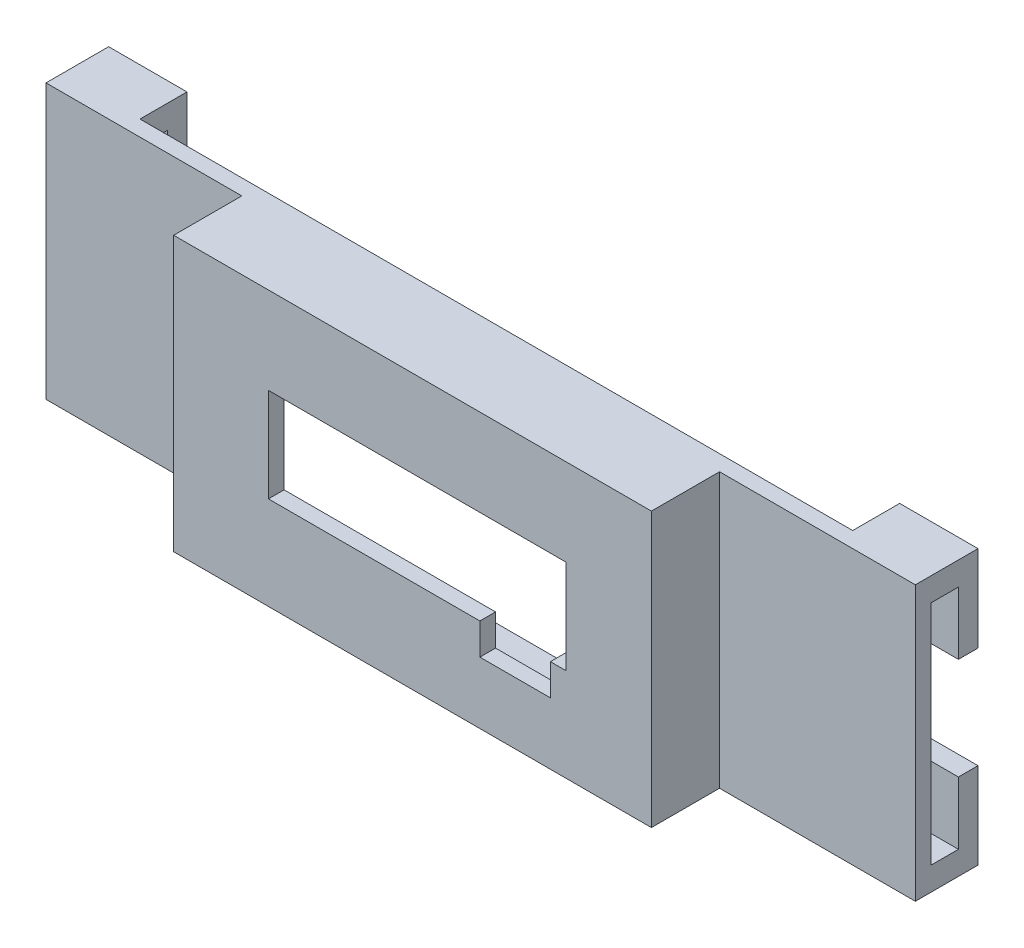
ISO-10303-21;
HEADER;
FILE_DESCRIPTION(('STEP AP214'),'2;1');
FILE_NAME('part.step','',(''),(''),'','','');
FILE_SCHEMA(('AUTOMOTIVE_DESIGN { 1 0 10303 214 1 1 1 1 }'));
ENDSEC;
DATA;
#1=APPLICATION_CONTEXT('core data for automotive mechanical design processes');
#2=APPLICATION_PROTOCOL_DEFINITION('international standard','automotive_design',2000,#1);
#3=PRODUCT_CONTEXT('',#1,'mechanical');
#4=PRODUCT('Part','Part','',(#3));
#5=PRODUCT_RELATED_PRODUCT_CATEGORY('part','',(#4));
#6=PRODUCT_DEFINITION_FORMATION('','',#4);
#7=PRODUCT_DEFINITION_CONTEXT('part definition',#1,'design');
#8=PRODUCT_DEFINITION('design','',#6,#7);
#9=PRODUCT_DEFINITION_SHAPE('','',#8);
#10=(LENGTH_UNIT() NAMED_UNIT(*) SI_UNIT(.MILLI.,.METRE.));
#11=(NAMED_UNIT(*) PLANE_ANGLE_UNIT() SI_UNIT($,.RADIAN.));
#12=(NAMED_UNIT(*) SI_UNIT($,.STERADIAN.) SOLID_ANGLE_UNIT());
#13=UNCERTAINTY_MEASURE_WITH_UNIT(LENGTH_MEASURE(1.E-05),#10,'distance_accuracy_value','');
#14=(GEOMETRIC_REPRESENTATION_CONTEXT(3) GLOBAL_UNCERTAINTY_ASSIGNED_CONTEXT((#13)) GLOBAL_UNIT_ASSIGNED_CONTEXT((#10,
#11,#12)) REPRESENTATION_CONTEXT('',''));
#15=CARTESIAN_POINT('',(0.,0.,0.));
#16=DIRECTION('',(0.,0.,1.));
#17=DIRECTION('',(1.,0.,0.));
#18=AXIS2_PLACEMENT_3D('',#15,#16,#17);
#19=CARTESIAN_POINT('',(-55.5,-14.5,-14.7));
#20=DIRECTION('',(0.,-1.,0.));
#21=DIRECTION('',(1.,0.,0.));
#22=AXIS2_PLACEMENT_3D('',#19,#20,#21);
#23=PLANE('',#22);
#24=DIRECTION('',(1.,0.,0.));
#25=VECTOR('',#24,1.);
#26=CARTESIAN_POINT('',(-55.5,-14.5,-12.2));
#27=LINE('',#26,#25);
#28=CARTESIAN_POINT('',(-55.5,-14.5,-12.2));
#29=VERTEX_POINT('',#28);
#30=CARTESIAN_POINT('',(-45.5,-14.5,-12.2));
#31=VERTEX_POINT('',#30);
#32=EDGE_CURVE('E318',#29,#31,#27,.T.);
#33=ORIENTED_EDGE('',*,*,#32,.F.);
#34=DIRECTION('',(0.,0.,1.));
#35=VECTOR('',#34,1.);
#36=CARTESIAN_POINT('',(-55.5,-14.5,-14.7));
#37=LINE('',#36,#35);
#38=CARTESIAN_POINT('',(-55.5,-14.5,-8.7));
#39=VERTEX_POINT('',#38);
#40=EDGE_CURVE('E323',#29,#39,#37,.T.);
#41=ORIENTED_EDGE('',*,*,#40,.T.);
#42=DIRECTION('',(1.,0.,0.));
#43=VECTOR('',#42,1.);
#44=CARTESIAN_POINT('',(-55.5,-14.5,-8.7));
#45=LINE('',#44,#43);
#46=CARTESIAN_POINT('',(-45.5,-14.5,-8.7));
#47=VERTEX_POINT('',#46);
#48=EDGE_CURVE('E324',#39,#47,#45,.T.);
#49=ORIENTED_EDGE('',*,*,#48,.T.);
#50=DIRECTION('',(0.,0.,1.));
#51=VECTOR('',#50,1.);
#52=CARTESIAN_POINT('',(-45.5,-14.5,-14.7));
#53=LINE('',#52,#51);
#54=EDGE_CURVE('E55',#31,#47,#53,.T.);
#55=ORIENTED_EDGE('',*,*,#54,.F.);
#56=EDGE_LOOP('',(#33,#41,#49,#55));
#57=FACE_BOUND('',#56,.T.);
#58=ADVANCED_FACE('F40',(#57),#23,.F.);
#59=CARTESIAN_POINT('',(0.,0.,-8.7));
#60=DIRECTION('',(0.,0.,-1.));
#61=DIRECTION('',(-1.,0.,0.));
#62=AXIS2_PLACEMENT_3D('',#59,#60,#61);
#63=PLANE('',#62);
#64=DIRECTION('',(-1.,0.,0.));
#65=VECTOR('',#64,1.);
#66=CARTESIAN_POINT('',(28.5,-15.5,-8.7));
#67=LINE('',#66,#65);
#68=CARTESIAN_POINT('',(28.5,-15.5,-8.7));
#69=VERTEX_POINT('',#68);
#70=CARTESIAN_POINT('',(-28.5,-15.5,-8.7));
#71=VERTEX_POINT('',#70);
#72=EDGE_CURVE('E501',#69,#71,#67,.T.);
#73=ORIENTED_EDGE('',*,*,#72,.F.);
#74=DIRECTION('',(0.,-1.,0.));
#75=VECTOR('',#74,1.);
#76=CARTESIAN_POINT('',(28.5,15.5,-8.7));
#77=LINE('',#76,#75);
#78=CARTESIAN_POINT('',(28.5,15.5,-8.7));
#79=VERTEX_POINT('',#78);
#80=EDGE_CURVE('E499',#79,#69,#77,.T.);
#81=ORIENTED_EDGE('',*,*,#80,.F.);
#82=DIRECTION('',(1.,0.,0.));
#83=VECTOR('',#82,1.);
#84=CARTESIAN_POINT('',(28.5,15.5,-8.7));
#85=LINE('',#84,#83);
#86=CARTESIAN_POINT('',(-28.5,15.5,-8.7));
#87=VERTEX_POINT('',#86);
#88=EDGE_CURVE('E507',#87,#79,#85,.T.);
#89=ORIENTED_EDGE('',*,*,#88,.F.);
#90=DIRECTION('',(0.,1.,0.));
#91=VECTOR('',#90,1.);
#92=CARTESIAN_POINT('',(-28.5,15.5,-8.7));
#93=LINE('',#92,#91);
#94=EDGE_CURVE('E504',#71,#87,#93,.T.);
#95=ORIENTED_EDGE('',*,*,#94,.F.);
#96=EDGE_LOOP('',(#73,#81,#89,#95));
#97=FACE_BOUND('',#96,.T.);
#98=DIRECTION('',(0.,-1.,0.));
#99=VECTOR('',#98,1.);
#100=CARTESIAN_POINT('',(-45.5,-17.5,-8.7));
#101=LINE('',#100,#99);
#102=CARTESIAN_POINT('',(-45.5,-17.5,-8.7));
#103=VERTEX_POINT('',#102);
#104=EDGE_CURVE('E327',#47,#103,#101,.T.);
#105=ORIENTED_EDGE('',*,*,#104,.F.);
#106=ORIENTED_EDGE('',*,*,#48,.F.);
#107=DIRECTION('',(0.,1.,0.));
#108=VECTOR('',#107,1.);
#109=CARTESIAN_POINT('',(-55.5,17.5,-8.7));
#110=LINE('',#109,#108);
#111=CARTESIAN_POINT('',(-55.5,14.5,-8.7));
#112=VERTEX_POINT('',#111);
#113=EDGE_CURVE('E387',#39,#112,#110,.T.);
#114=ORIENTED_EDGE('',*,*,#113,.T.);
#115=DIRECTION('',(1.,0.,0.));
#116=VECTOR('',#115,1.);
#117=CARTESIAN_POINT('',(-55.5,14.5,-8.7));
#118=LINE('',#117,#116);
#119=CARTESIAN_POINT('',(-45.5,14.5,-8.7));
#120=VERTEX_POINT('',#119);
#121=EDGE_CURVE('E369',#112,#120,#118,.T.);
#122=ORIENTED_EDGE('',*,*,#121,.T.);
#123=DIRECTION('',(0.,1.,0.));
#124=VECTOR('',#123,1.);
#125=CARTESIAN_POINT('',(-45.5,17.5,-8.7));
#126=LINE('',#125,#124);
#127=CARTESIAN_POINT('',(-45.5,17.5,-8.7));
#128=VERTEX_POINT('',#127);
#129=EDGE_CURVE('E365',#120,#128,#126,.T.);
#130=ORIENTED_EDGE('',*,*,#129,.T.);
#131=DIRECTION('',(1.,0.,0.));
#132=VECTOR('',#131,1.);
#133=CARTESIAN_POINT('',(30.5,17.5,-8.7));
#134=LINE('',#133,#132);
#135=CARTESIAN_POINT('',(45.5,17.5,-8.7));
#136=VERTEX_POINT('',#135);
#137=EDGE_CURVE('E529',#128,#136,#134,.T.);
#138=ORIENTED_EDGE('',*,*,#137,.T.);
#139=DIRECTION('',(0.,1.,0.));
#140=VECTOR('',#139,1.);
#141=CARTESIAN_POINT('',(45.5,17.5,-8.7));
#142=LINE('',#141,#140);
#143=CARTESIAN_POINT('',(45.5,14.5,-8.7));
#144=VERTEX_POINT('',#143);
#145=EDGE_CURVE('E464',#144,#136,#142,.T.);
#146=ORIENTED_EDGE('',*,*,#145,.F.);
#147=DIRECTION('',(-1.,0.,0.));
#148=VECTOR('',#147,1.);
#149=CARTESIAN_POINT('',(55.5,14.5,-8.7));
#150=LINE('',#149,#148);
#151=CARTESIAN_POINT('',(55.5,14.5,-8.7));
#152=VERTEX_POINT('',#151);
#153=EDGE_CURVE('E460',#152,#144,#150,.T.);
#154=ORIENTED_EDGE('',*,*,#153,.F.);
#155=DIRECTION('',(0.,1.,0.));
#156=VECTOR('',#155,1.);
#157=CARTESIAN_POINT('',(55.5,17.5,-8.7));
#158=LINE('',#157,#156);
#159=CARTESIAN_POINT('',(55.5,-14.5,-8.7));
#160=VERTEX_POINT('',#159);
#161=EDGE_CURVE('E482',#160,#152,#158,.T.);
#162=ORIENTED_EDGE('',*,*,#161,.F.);
#163=DIRECTION('',(-1.,0.,0.));
#164=VECTOR('',#163,1.);
#165=CARTESIAN_POINT('',(55.5,-14.5,-8.7));
#166=LINE('',#165,#164);
#167=CARTESIAN_POINT('',(45.5,-14.5,-8.7));
#168=VERTEX_POINT('',#167);
#169=EDGE_CURVE('E427',#160,#168,#166,.T.);
#170=ORIENTED_EDGE('',*,*,#169,.T.);
#171=DIRECTION('',(0.,-1.,0.));
#172=VECTOR('',#171,1.);
#173=CARTESIAN_POINT('',(45.5,-17.5,-8.7));
#174=LINE('',#173,#172);
#175=CARTESIAN_POINT('',(45.5,-17.5,-8.7));
#176=VERTEX_POINT('',#175);
#177=EDGE_CURVE('E423',#168,#176,#174,.T.);
#178=ORIENTED_EDGE('',*,*,#177,.T.);
#179=DIRECTION('',(-1.,0.,0.));
#180=VECTOR('',#179,1.);
#181=CARTESIAN_POINT('',(30.5,-17.5,-8.7));
#182=LINE('',#181,#180);
#183=EDGE_CURVE('E62',#176,#103,#182,.T.);
#184=ORIENTED_EDGE('',*,*,#183,.T.);
#185=EDGE_LOOP('',(#105,#106,#114,#122,#130,#138,#146,#154,#162,#170,#178,#184));
#186=FACE_BOUND('',#185,.T.);
#187=ADVANCED_FACE('F642',(#97,#186),#63,.T.);
#188=CARTESIAN_POINT('',(55.5,14.5,-14.7));
#189=DIRECTION('',(0.,1.,0.));
#190=DIRECTION('',(0.,0.,1.));
#191=AXIS2_PLACEMENT_3D('',#188,#189,#190);
#192=PLANE('',#191);
#193=DIRECTION('',(-1.,0.,0.));
#194=VECTOR('',#193,1.);
#195=CARTESIAN_POINT('',(55.5,14.5,-12.2));
#196=LINE('',#195,#194);
#197=CARTESIAN_POINT('',(55.5,14.5,-12.2));
#198=VERTEX_POINT('',#197);
#199=CARTESIAN_POINT('',(45.5,14.5,-12.2));
#200=VERTEX_POINT('',#199);
#201=EDGE_CURVE('E442',#198,#200,#196,.T.);
#202=ORIENTED_EDGE('',*,*,#201,.F.);
#203=DIRECTION('',(0.,0.,1.));
#204=VECTOR('',#203,1.);
#205=CARTESIAN_POINT('',(55.5,14.5,-14.7));
#206=LINE('',#205,#204);
#207=EDGE_CURVE('E478',#198,#152,#206,.T.);
#208=ORIENTED_EDGE('',*,*,#207,.T.);
#209=ORIENTED_EDGE('',*,*,#153,.T.);
#210=DIRECTION('',(0.,0.,1.));
#211=VECTOR('',#210,1.);
#212=CARTESIAN_POINT('',(45.5,14.5,-14.7));
#213=LINE('',#212,#211);
#214=EDGE_CURVE('E476',#200,#144,#213,.T.);
#215=ORIENTED_EDGE('',*,*,#214,.F.);
#216=EDGE_LOOP('',(#202,#208,#209,#215));
#217=FACE_BOUND('',#216,.T.);
#218=ADVANCED_FACE('F647',(#217),#192,.F.);
#219=CARTESIAN_POINT('',(30.5,17.5,2.));
#220=DIRECTION('',(-1.,0.,0.));
#221=DIRECTION('',(0.,-1.,0.));
#222=AXIS2_PLACEMENT_3D('',#219,#220,#221);
#223=PLANE('',#222);
#224=DIRECTION('',(0.,-1.,0.));
#225=VECTOR('',#224,1.);
#226=CARTESIAN_POINT('',(30.5,17.5,-6.7));
#227=LINE('',#226,#225);
#228=CARTESIAN_POINT('',(30.5,17.5,-6.7));
#229=VERTEX_POINT('',#228);
#230=CARTESIAN_POINT('',(30.5,-17.5,-6.7));
#231=VERTEX_POINT('',#230);
#232=EDGE_CURVE('E481',#229,#231,#227,.T.);
#233=ORIENTED_EDGE('',*,*,#232,.F.);
#234=DIRECTION('',(0.,0.,-1.));
#235=VECTOR('',#234,1.);
#236=CARTESIAN_POINT('',(30.5,17.5,2.));
#237=LINE('',#236,#235);
#238=CARTESIAN_POINT('',(30.5,17.5,2.));
#239=VERTEX_POINT('',#238);
#240=EDGE_CURVE('E602',#239,#229,#237,.T.);
#241=ORIENTED_EDGE('',*,*,#240,.F.);
#242=DIRECTION('',(0.,1.,0.));
#243=VECTOR('',#242,1.);
#244=CARTESIAN_POINT('',(30.5,17.5,2.));
#245=LINE('',#244,#243);
#246=CARTESIAN_POINT('',(30.5,-17.5,2.));
#247=VERTEX_POINT('',#246);
#248=EDGE_CURVE('E595',#247,#239,#245,.T.);
#249=ORIENTED_EDGE('',*,*,#248,.F.);
#250=DIRECTION('',(0.,0.,-1.));
#251=VECTOR('',#250,1.);
#252=CARTESIAN_POINT('',(30.5,-17.5,2.));
#253=LINE('',#252,#251);
#254=EDGE_CURVE('E48',#247,#231,#253,.T.);
#255=ORIENTED_EDGE('',*,*,#254,.T.);
#256=EDGE_LOOP('',(#233,#241,#249,#255));
#257=FACE_BOUND('',#256,.T.);
#258=ADVANCED_FACE('F607',(#257),#223,.F.);
#259=CARTESIAN_POINT('',(0.,0.,2.));
#260=DIRECTION('',(0.,0.,1.));
#261=DIRECTION('',(1.,0.,0.));
#262=AXIS2_PLACEMENT_3D('',#259,#260,#261);
#263=PLANE('',#262);
#264=DIRECTION('',(0.,-1.,0.));
#265=VECTOR('',#264,1.);
#266=CARTESIAN_POINT('',(-30.5,17.5,2.));
#267=LINE('',#266,#265);
#268=CARTESIAN_POINT('',(-30.5,17.5,2.));
#269=VERTEX_POINT('',#268);
#270=CARTESIAN_POINT('',(-30.5,-17.5,2.));
#271=VERTEX_POINT('',#270);
#272=EDGE_CURVE('E590',#269,#271,#267,.T.);
#273=ORIENTED_EDGE('',*,*,#272,.T.);
#274=DIRECTION('',(1.,0.,0.));
#275=VECTOR('',#274,1.);
#276=CARTESIAN_POINT('',(-30.5,-17.5,2.));
#277=LINE('',#276,#275);
#278=EDGE_CURVE('E593',#271,#247,#277,.T.);
#279=ORIENTED_EDGE('',*,*,#278,.T.);
#280=ORIENTED_EDGE('',*,*,#248,.T.);
#281=DIRECTION('',(-1.,0.,0.));
#282=VECTOR('',#281,1.);
#283=CARTESIAN_POINT('',(-30.5,17.5,2.));
#284=LINE('',#283,#282);
#285=EDGE_CURVE('E597',#239,#269,#284,.T.);
#286=ORIENTED_EDGE('',*,*,#285,.T.);
#287=EDGE_LOOP('',(#273,#279,#280,#286));
#288=FACE_BOUND('',#287,.T.);
#289=DIRECTION('',(1.,0.,0.));
#290=VECTOR('',#289,1.);
#291=CARTESIAN_POINT('',(-18.4,-5.6,2.));
#292=LINE('',#291,#290);
#293=CARTESIAN_POINT('',(-18.4,-5.6,2.));
#294=VERTEX_POINT('',#293);
#295=CARTESIAN_POINT('',(8.6,-5.6,2.));
#296=VERTEX_POINT('',#295);
#297=EDGE_CURVE('E534',#294,#296,#292,.T.);
#298=ORIENTED_EDGE('',*,*,#297,.F.);
#299=DIRECTION('',(0.,-1.,0.));
#300=VECTOR('',#299,1.);
#301=CARTESIAN_POINT('',(-18.4,6.4,2.));
#302=LINE('',#301,#300);
#303=CARTESIAN_POINT('',(-18.4,6.4,2.));
#304=VERTEX_POINT('',#303);
#305=EDGE_CURVE('E532',#304,#294,#302,.T.);
#306=ORIENTED_EDGE('',*,*,#305,.F.);
#307=DIRECTION('',(-1.,0.,0.));
#308=VECTOR('',#307,1.);
#309=CARTESIAN_POINT('',(-18.4,6.4,2.));
#310=LINE('',#309,#308);
#311=CARTESIAN_POINT('',(19.6,6.4,2.));
#312=VERTEX_POINT('',#311);
#313=EDGE_CURVE('E548',#312,#304,#310,.T.);
#314=ORIENTED_EDGE('',*,*,#313,.F.);
#315=DIRECTION('',(0.,1.,0.));
#316=VECTOR('',#315,1.);
#317=CARTESIAN_POINT('',(19.6,6.4,2.));
#318=LINE('',#317,#316);
#319=CARTESIAN_POINT('',(19.6,-5.6,2.));
#320=VERTEX_POINT('',#319);
#321=EDGE_CURVE('E545',#320,#312,#318,.T.);
#322=ORIENTED_EDGE('',*,*,#321,.F.);
#323=DIRECTION('',(1.,0.,0.));
#324=VECTOR('',#323,1.);
#325=CARTESIAN_POINT('',(17.6,-5.6,2.));
#326=LINE('',#325,#324);
#327=CARTESIAN_POINT('',(17.6,-5.6,2.));
#328=VERTEX_POINT('',#327);
#329=EDGE_CURVE('E543',#328,#320,#326,.T.);
#330=ORIENTED_EDGE('',*,*,#329,.F.);
#331=DIRECTION('',(0.,1.,0.));
#332=VECTOR('',#331,1.);
#333=CARTESIAN_POINT('',(17.6,-5.6,2.));
#334=LINE('',#333,#332);
#335=CARTESIAN_POINT('',(17.6,-9.6,2.));
#336=VERTEX_POINT('',#335);
#337=EDGE_CURVE('E541',#336,#328,#334,.T.);
#338=ORIENTED_EDGE('',*,*,#337,.F.);
#339=DIRECTION('',(1.,0.,0.));
#340=VECTOR('',#339,1.);
#341=CARTESIAN_POINT('',(8.6,-9.6,2.));
#342=LINE('',#341,#340);
#343=CARTESIAN_POINT('',(8.6,-9.6,2.));
#344=VERTEX_POINT('',#343);
#345=EDGE_CURVE('E539',#344,#336,#342,.T.);
#346=ORIENTED_EDGE('',*,*,#345,.F.);
#347=DIRECTION('',(0.,-1.,0.));
#348=VECTOR('',#347,1.);
#349=CARTESIAN_POINT('',(8.6,-5.6,2.));
#350=LINE('',#349,#348);
#351=EDGE_CURVE('E537',#296,#344,#350,.T.);
#352=ORIENTED_EDGE('',*,*,#351,.F.);
#353=EDGE_LOOP('',(#298,#306,#314,#322,#330,#338,#346,#352));
#354=FACE_BOUND('',#353,.T.);
#355=ADVANCED_FACE('F668',(#288,#354),#263,.T.);
#356=CARTESIAN_POINT('',(0.,0.,0.));
#357=DIRECTION('',(0.,0.,1.));
#358=DIRECTION('',(1.,0.,0.));
#359=AXIS2_PLACEMENT_3D('',#356,#357,#358);
#360=PLANE('',#359);
#361=DIRECTION('',(1.,0.,0.));
#362=VECTOR('',#361,1.);
#363=CARTESIAN_POINT('',(28.5,15.5,0.));
#364=LINE('',#363,#362);
#365=CARTESIAN_POINT('',(-28.5,15.5,0.));
#366=VERTEX_POINT('',#365);
#367=CARTESIAN_POINT('',(28.5,15.5,0.));
#368=VERTEX_POINT('',#367);
#369=EDGE_CURVE('E502',#366,#368,#364,.T.);
#370=ORIENTED_EDGE('',*,*,#369,.T.);
#371=DIRECTION('',(0.,-1.,0.));
#372=VECTOR('',#371,1.);
#373=CARTESIAN_POINT('',(28.5,15.5,0.));
#374=LINE('',#373,#372);
#375=CARTESIAN_POINT('',(28.5,-15.5,0.));
#376=VERTEX_POINT('',#375);
#377=EDGE_CURVE('E498',#368,#376,#374,.T.);
#378=ORIENTED_EDGE('',*,*,#377,.T.);
#379=DIRECTION('',(-1.,0.,0.));
#380=VECTOR('',#379,1.);
#381=CARTESIAN_POINT('',(28.5,-15.5,0.));
#382=LINE('',#381,#380);
#383=CARTESIAN_POINT('',(-28.5,-15.5,0.));
#384=VERTEX_POINT('',#383);
#385=EDGE_CURVE('E512',#376,#384,#382,.T.);
#386=ORIENTED_EDGE('',*,*,#385,.T.);
#387=DIRECTION('',(0.,1.,0.));
#388=VECTOR('',#387,1.);
#389=CARTESIAN_POINT('',(-28.5,15.5,0.));
#390=LINE('',#389,#388);
#391=EDGE_CURVE('E515',#384,#366,#390,.T.);
#392=ORIENTED_EDGE('',*,*,#391,.T.);
#393=EDGE_LOOP('',(#370,#378,#386,#392));
#394=FACE_BOUND('',#393,.T.);
#395=DIRECTION('',(0.,-1.,0.));
#396=VECTOR('',#395,1.);
#397=CARTESIAN_POINT('',(-18.4,6.4,0.));
#398=LINE('',#397,#396);
#399=CARTESIAN_POINT('',(-18.4,6.4,0.));
#400=VERTEX_POINT('',#399);
#401=CARTESIAN_POINT('',(-18.4,-5.6,0.));
#402=VERTEX_POINT('',#401);
#403=EDGE_CURVE('E531',#400,#402,#398,.T.);
#404=ORIENTED_EDGE('',*,*,#403,.T.);
#405=DIRECTION('',(1.,0.,0.));
#406=VECTOR('',#405,1.);
#407=CARTESIAN_POINT('',(-18.4,-5.6,0.));
#408=LINE('',#407,#406);
#409=CARTESIAN_POINT('',(8.6,-5.6,0.));
#410=VERTEX_POINT('',#409);
#411=EDGE_CURVE('E553',#402,#410,#408,.T.);
#412=ORIENTED_EDGE('',*,*,#411,.T.);
#413=DIRECTION('',(0.,-1.,0.));
#414=VECTOR('',#413,1.);
#415=CARTESIAN_POINT('',(8.6,-5.6,0.));
#416=LINE('',#415,#414);
#417=CARTESIAN_POINT('',(8.6,-9.6,0.));
#418=VERTEX_POINT('',#417);
#419=EDGE_CURVE('E556',#410,#418,#416,.T.);
#420=ORIENTED_EDGE('',*,*,#419,.T.);
#421=DIRECTION('',(1.,0.,0.));
#422=VECTOR('',#421,1.);
#423=CARTESIAN_POINT('',(8.6,-9.6,0.));
#424=LINE('',#423,#422);
#425=CARTESIAN_POINT('',(17.6,-9.6,0.));
#426=VERTEX_POINT('',#425);
#427=EDGE_CURVE('E559',#418,#426,#424,.T.);
#428=ORIENTED_EDGE('',*,*,#427,.T.);
#429=DIRECTION('',(0.,1.,0.));
#430=VECTOR('',#429,1.);
#431=CARTESIAN_POINT('',(17.6,-5.6,0.));
#432=LINE('',#431,#430);
#433=CARTESIAN_POINT('',(17.6,-5.6,0.));
#434=VERTEX_POINT('',#433);
#435=EDGE_CURVE('E562',#426,#434,#432,.T.);
#436=ORIENTED_EDGE('',*,*,#435,.T.);
#437=DIRECTION('',(1.,0.,0.));
#438=VECTOR('',#437,1.);
#439=CARTESIAN_POINT('',(17.6,-5.6,0.));
#440=LINE('',#439,#438);
#441=CARTESIAN_POINT('',(19.6,-5.6,0.));
#442=VERTEX_POINT('',#441);
#443=EDGE_CURVE('E565',#434,#442,#440,.T.);
#444=ORIENTED_EDGE('',*,*,#443,.T.);
#445=DIRECTION('',(0.,1.,0.));
#446=VECTOR('',#445,1.);
#447=CARTESIAN_POINT('',(19.6,6.4,0.));
#448=LINE('',#447,#446);
#449=CARTESIAN_POINT('',(19.6,6.4,0.));
#450=VERTEX_POINT('',#449);
#451=EDGE_CURVE('E568',#442,#450,#448,.T.);
#452=ORIENTED_EDGE('',*,*,#451,.T.);
#453=DIRECTION('',(-1.,0.,0.));
#454=VECTOR('',#453,1.);
#455=CARTESIAN_POINT('',(-18.4,6.4,0.));
#456=LINE('',#455,#454);
#457=EDGE_CURVE('E535',#450,#400,#456,.T.);
#458=ORIENTED_EDGE('',*,*,#457,.T.);
#459=EDGE_LOOP('',(#404,#412,#420,#428,#436,#444,#452,#458));
#460=FACE_BOUND('',#459,.T.);
#461=ADVANCED_FACE('F811',(#394,#460),#360,.F.);
#462=CARTESIAN_POINT('',(-30.5,17.5,2.));
#463=DIRECTION('',(1.,0.,0.));
#464=DIRECTION('',(0.,0.,-1.));
#465=AXIS2_PLACEMENT_3D('',#462,#463,#464);
#466=PLANE('',#465);
#467=DIRECTION('',(0.,0.,-1.));
#468=VECTOR('',#467,1.);
#469=CARTESIAN_POINT('',(-30.5,17.5,2.));
#470=LINE('',#469,#468);
#471=CARTESIAN_POINT('',(-30.5,17.5,-6.7));
#472=VERTEX_POINT('',#471);
#473=EDGE_CURVE('E599',#269,#472,#470,.T.);
#474=ORIENTED_EDGE('',*,*,#473,.T.);
#475=DIRECTION('',(0.,-1.,0.));
#476=VECTOR('',#475,1.);
#477=CARTESIAN_POINT('',(-30.5,17.5,-6.7));
#478=LINE('',#477,#476);
#479=CARTESIAN_POINT('',(-30.5,-17.5,-6.7));
#480=VERTEX_POINT('',#479);
#481=EDGE_CURVE('E386',#472,#480,#478,.T.);
#482=ORIENTED_EDGE('',*,*,#481,.T.);
#483=DIRECTION('',(0.,0.,-1.));
#484=VECTOR('',#483,1.);
#485=CARTESIAN_POINT('',(-30.5,-17.5,2.));
#486=LINE('',#485,#484);
#487=EDGE_CURVE('E11',#271,#480,#486,.T.);
#488=ORIENTED_EDGE('',*,*,#487,.F.);
#489=ORIENTED_EDGE('',*,*,#272,.F.);
#490=EDGE_LOOP('',(#474,#482,#488,#489));
#491=FACE_BOUND('',#490,.T.);
#492=ADVANCED_FACE('F42',(#491),#466,.F.);
#493=CARTESIAN_POINT('',(-30.5,-17.5,2.));
#494=DIRECTION('',(0.,1.,0.));
#495=DIRECTION('',(0.,0.,1.));
#496=AXIS2_PLACEMENT_3D('',#493,#494,#495);
#497=PLANE('',#496);
#498=ORIENTED_EDGE('',*,*,#487,.T.);
#499=DIRECTION('',(1.,0.,0.));
#500=VECTOR('',#499,1.);
#501=CARTESIAN_POINT('',(-55.5,-17.5,-6.7));
#502=LINE('',#501,#500);
#503=CARTESIAN_POINT('',(-55.5,-17.5,-6.7));
#504=VERTEX_POINT('',#503);
#505=EDGE_CURVE('E401',#504,#480,#502,.T.);
#506=ORIENTED_EDGE('',*,*,#505,.F.);
#507=DIRECTION('',(0.,0.,-1.));
#508=VECTOR('',#507,1.);
#509=CARTESIAN_POINT('',(-55.5,-17.5,-8.7));
#510=LINE('',#509,#508);
#511=CARTESIAN_POINT('',(-55.5,-17.5,-14.7));
#512=VERTEX_POINT('',#511);
#513=EDGE_CURVE('E389',#504,#512,#510,.T.);
#514=ORIENTED_EDGE('',*,*,#513,.T.);
#515=DIRECTION('',(-1.,0.,0.));
#516=VECTOR('',#515,1.);
#517=CARTESIAN_POINT('',(-55.5,-17.5,-14.7));
#518=LINE('',#517,#516);
#519=CARTESIAN_POINT('',(-45.5,-17.5,-14.7));
#520=VERTEX_POINT('',#519);
#521=EDGE_CURVE('E336',#520,#512,#518,.T.);
#522=ORIENTED_EDGE('',*,*,#521,.F.);
#523=DIRECTION('',(0.,0.,1.));
#524=VECTOR('',#523,1.);
#525=CARTESIAN_POINT('',(-45.5,-17.5,-14.7));
#526=LINE('',#525,#524);
#527=EDGE_CURVE('E338',#520,#103,#526,.T.);
#528=ORIENTED_EDGE('',*,*,#527,.T.);
#529=ORIENTED_EDGE('',*,*,#183,.F.);
#530=DIRECTION('',(0.,0.,1.));
#531=VECTOR('',#530,1.);
#532=CARTESIAN_POINT('',(45.5,-17.5,-14.7));
#533=LINE('',#532,#531);
#534=CARTESIAN_POINT('',(45.5,-17.5,-14.7));
#535=VERTEX_POINT('',#534);
#536=EDGE_CURVE('E440',#535,#176,#533,.T.);
#537=ORIENTED_EDGE('',*,*,#536,.F.);
#538=DIRECTION('',(1.,0.,0.));
#539=VECTOR('',#538,1.);
#540=CARTESIAN_POINT('',(55.5,-17.5,-14.7));
#541=LINE('',#540,#539);
#542=CARTESIAN_POINT('',(55.5,-17.5,-14.7));
#543=VERTEX_POINT('',#542);
#544=EDGE_CURVE('E426',#535,#543,#541,.T.);
#545=ORIENTED_EDGE('',*,*,#544,.T.);
#546=DIRECTION('',(0.,0.,-1.));
#547=VECTOR('',#546,1.);
#548=CARTESIAN_POINT('',(55.5,-17.5,-8.7));
#549=LINE('',#548,#547);
#550=CARTESIAN_POINT('',(55.5,-17.5,-6.7));
#551=VERTEX_POINT('',#550);
#552=EDGE_CURVE('E488',#551,#543,#549,.T.);
#553=ORIENTED_EDGE('',*,*,#552,.F.);
#554=DIRECTION('',(-1.,0.,0.));
#555=VECTOR('',#554,1.);
#556=CARTESIAN_POINT('',(55.5,-17.5,-6.7));
#557=LINE('',#556,#555);
#558=EDGE_CURVE('E490',#551,#231,#557,.T.);
#559=ORIENTED_EDGE('',*,*,#558,.T.);
#560=ORIENTED_EDGE('',*,*,#254,.F.);
#561=ORIENTED_EDGE('',*,*,#278,.F.);
#562=EDGE_LOOP('',(#498,#506,#514,#522,#528,#529,#537,#545,#553,#559,#560,#561));
#563=FACE_BOUND('',#562,.T.);
#564=ADVANCED_FACE('F616',(#563),#497,.F.);
#565=CARTESIAN_POINT('',(-30.5,17.5,2.));
#566=DIRECTION('',(0.,-1.,0.));
#567=DIRECTION('',(0.,0.,-1.));
#568=AXIS2_PLACEMENT_3D('',#565,#566,#567);
#569=PLANE('',#568);
#570=ORIENTED_EDGE('',*,*,#240,.T.);
#571=DIRECTION('',(-1.,0.,0.));
#572=VECTOR('',#571,1.);
#573=CARTESIAN_POINT('',(55.5,17.5,-6.7));
#574=LINE('',#573,#572);
#575=CARTESIAN_POINT('',(55.5,17.5,-6.7));
#576=VERTEX_POINT('',#575);
#577=EDGE_CURVE('E495',#576,#229,#574,.T.);
#578=ORIENTED_EDGE('',*,*,#577,.F.);
#579=DIRECTION('',(0.,0.,1.));
#580=VECTOR('',#579,1.);
#581=CARTESIAN_POINT('',(55.5,17.5,-8.7));
#582=LINE('',#581,#580);
#583=CARTESIAN_POINT('',(55.5,17.5,-14.7));
#584=VERTEX_POINT('',#583);
#585=EDGE_CURVE('E484',#584,#576,#582,.T.);
#586=ORIENTED_EDGE('',*,*,#585,.F.);
#587=DIRECTION('',(1.,0.,0.));
#588=VECTOR('',#587,1.);
#589=CARTESIAN_POINT('',(55.5,17.5,-14.7));
#590=LINE('',#589,#588);
#591=CARTESIAN_POINT('',(45.5,17.5,-14.7));
#592=VERTEX_POINT('',#591);
#593=EDGE_CURVE('E466',#592,#584,#590,.T.);
#594=ORIENTED_EDGE('',*,*,#593,.F.);
#595=DIRECTION('',(0.,0.,1.));
#596=VECTOR('',#595,1.);
#597=CARTESIAN_POINT('',(45.5,17.5,-14.7));
#598=LINE('',#597,#596);
#599=EDGE_CURVE('E469',#592,#136,#598,.T.);
#600=ORIENTED_EDGE('',*,*,#599,.T.);
#601=ORIENTED_EDGE('',*,*,#137,.F.);
#602=DIRECTION('',(0.,0.,1.));
#603=VECTOR('',#602,1.);
#604=CARTESIAN_POINT('',(-45.5,17.5,-14.7));
#605=LINE('',#604,#603);
#606=CARTESIAN_POINT('',(-45.5,17.5,-14.7));
#607=VERTEX_POINT('',#606);
#608=EDGE_CURVE('E383',#607,#128,#605,.T.);
#609=ORIENTED_EDGE('',*,*,#608,.F.);
#610=DIRECTION('',(-1.,0.,0.));
#611=VECTOR('',#610,1.);
#612=CARTESIAN_POINT('',(-55.5,17.5,-14.7));
#613=LINE('',#612,#611);
#614=CARTESIAN_POINT('',(-55.5,17.5,-14.7));
#615=VERTEX_POINT('',#614);
#616=EDGE_CURVE('E368',#607,#615,#613,.T.);
#617=ORIENTED_EDGE('',*,*,#616,.T.);
#618=DIRECTION('',(0.,0.,1.));
#619=VECTOR('',#618,1.);
#620=CARTESIAN_POINT('',(-55.5,17.5,-8.7));
#621=LINE('',#620,#619);
#622=CARTESIAN_POINT('',(-55.5,17.5,-6.7));
#623=VERTEX_POINT('',#622);
#624=EDGE_CURVE('E394',#615,#623,#621,.T.);
#625=ORIENTED_EDGE('',*,*,#624,.T.);
#626=DIRECTION('',(1.,0.,0.));
#627=VECTOR('',#626,1.);
#628=CARTESIAN_POINT('',(-55.5,17.5,-6.7));
#629=LINE('',#628,#627);
#630=EDGE_CURVE('E397',#623,#472,#629,.T.);
#631=ORIENTED_EDGE('',*,*,#630,.T.);
#632=ORIENTED_EDGE('',*,*,#473,.F.);
#633=ORIENTED_EDGE('',*,*,#285,.F.);
#634=EDGE_LOOP('',(#570,#578,#586,#594,#600,#601,#609,#617,#625,#631,#632,#633));
#635=FACE_BOUND('',#634,.T.);
#636=ADVANCED_FACE('F663',(#635),#569,.F.);
#637=CARTESIAN_POINT('',(-18.4,6.4,2.));
#638=DIRECTION('',(1.,0.,0.));
#639=DIRECTION('',(0.,0.,-1.));
#640=AXIS2_PLACEMENT_3D('',#637,#638,#639);
#641=PLANE('',#640);
#642=ORIENTED_EDGE('',*,*,#403,.F.);
#643=DIRECTION('',(0.,0.,-1.));
#644=VECTOR('',#643,1.);
#645=CARTESIAN_POINT('',(-18.4,6.4,2.));
#646=LINE('',#645,#644);
#647=EDGE_CURVE('E550',#304,#400,#646,.T.);
#648=ORIENTED_EDGE('',*,*,#647,.F.);
#649=ORIENTED_EDGE('',*,*,#305,.T.);
#650=DIRECTION('',(0.,0.,-1.));
#651=VECTOR('',#650,1.);
#652=CARTESIAN_POINT('',(-18.4,-5.6,2.));
#653=LINE('',#652,#651);
#654=EDGE_CURVE('E587',#294,#402,#653,.T.);
#655=ORIENTED_EDGE('',*,*,#654,.T.);
#656=EDGE_LOOP('',(#642,#648,#649,#655));
#657=FACE_BOUND('',#656,.T.);
#658=ADVANCED_FACE('F804',(#657),#641,.T.);
#659=CARTESIAN_POINT('',(-18.4,-5.6,2.));
#660=DIRECTION('',(0.,1.,0.));
#661=DIRECTION('',(0.,0.,1.));
#662=AXIS2_PLACEMENT_3D('',#659,#660,#661);
#663=PLANE('',#662);
#664=ORIENTED_EDGE('',*,*,#411,.F.);
#665=ORIENTED_EDGE('',*,*,#654,.F.);
#666=ORIENTED_EDGE('',*,*,#297,.T.);
#667=DIRECTION('',(0.,0.,-1.));
#668=VECTOR('',#667,1.);
#669=CARTESIAN_POINT('',(8.6,-5.6,2.));
#670=LINE('',#669,#668);
#671=EDGE_CURVE('E585',#296,#410,#670,.T.);
#672=ORIENTED_EDGE('',*,*,#671,.T.);
#673=EDGE_LOOP('',(#664,#665,#666,#672));
#674=FACE_BOUND('',#673,.T.);
#675=ADVANCED_FACE('F800',(#674),#663,.T.);
#676=CARTESIAN_POINT('',(8.6,-5.6,2.));
#677=DIRECTION('',(1.,0.,0.));
#678=DIRECTION('',(0.,0.,-1.));
#679=AXIS2_PLACEMENT_3D('',#676,#677,#678);
#680=PLANE('',#679);
#681=ORIENTED_EDGE('',*,*,#419,.F.);
#682=ORIENTED_EDGE('',*,*,#671,.F.);
#683=ORIENTED_EDGE('',*,*,#351,.T.);
#684=DIRECTION('',(0.,0.,-1.));
#685=VECTOR('',#684,1.);
#686=CARTESIAN_POINT('',(8.6,-9.6,2.));
#687=LINE('',#686,#685);
#688=EDGE_CURVE('E583',#344,#418,#687,.T.);
#689=ORIENTED_EDGE('',*,*,#688,.T.);
#690=EDGE_LOOP('',(#681,#682,#683,#689));
#691=FACE_BOUND('',#690,.T.);
#692=ADVANCED_FACE('F796',(#691),#680,.T.);
#693=CARTESIAN_POINT('',(8.6,-9.6,2.));
#694=DIRECTION('',(0.,1.,0.));
#695=DIRECTION('',(-1.,0.,0.));
#696=AXIS2_PLACEMENT_3D('',#693,#694,#695);
#697=PLANE('',#696);
#698=ORIENTED_EDGE('',*,*,#427,.F.);
#699=ORIENTED_EDGE('',*,*,#688,.F.);
#700=ORIENTED_EDGE('',*,*,#345,.T.);
#701=DIRECTION('',(0.,0.,-1.));
#702=VECTOR('',#701,1.);
#703=CARTESIAN_POINT('',(17.6,-9.6,2.));
#704=LINE('',#703,#702);
#705=EDGE_CURVE('E581',#336,#426,#704,.T.);
#706=ORIENTED_EDGE('',*,*,#705,.T.);
#707=EDGE_LOOP('',(#698,#699,#700,#706));
#708=FACE_BOUND('',#707,.T.);
#709=ADVANCED_FACE('F792',(#708),#697,.T.);
#710=CARTESIAN_POINT('',(17.6,-5.6,2.));
#711=DIRECTION('',(-1.,0.,0.));
#712=DIRECTION('',(0.,0.,1.));
#713=AXIS2_PLACEMENT_3D('',#710,#711,#712);
#714=PLANE('',#713);
#715=ORIENTED_EDGE('',*,*,#435,.F.);
#716=ORIENTED_EDGE('',*,*,#705,.F.);
#717=ORIENTED_EDGE('',*,*,#337,.T.);
#718=DIRECTION('',(0.,0.,-1.));
#719=VECTOR('',#718,1.);
#720=CARTESIAN_POINT('',(17.6,-5.6,2.));
#721=LINE('',#720,#719);
#722=EDGE_CURVE('E579',#328,#434,#721,.T.);
#723=ORIENTED_EDGE('',*,*,#722,.T.);
#724=EDGE_LOOP('',(#715,#716,#717,#723));
#725=FACE_BOUND('',#724,.T.);
#726=ADVANCED_FACE('F788',(#725),#714,.T.);
#727=CARTESIAN_POINT('',(17.6,-5.6,2.));
#728=DIRECTION('',(0.,1.,0.));
#729=DIRECTION('',(0.,0.,1.));
#730=AXIS2_PLACEMENT_3D('',#727,#728,#729);
#731=PLANE('',#730);
#732=ORIENTED_EDGE('',*,*,#443,.F.);
#733=ORIENTED_EDGE('',*,*,#722,.F.);
#734=ORIENTED_EDGE('',*,*,#329,.T.);
#735=DIRECTION('',(0.,0.,-1.));
#736=VECTOR('',#735,1.);
#737=CARTESIAN_POINT('',(19.6,-5.6,2.));
#738=LINE('',#737,#736);
#739=EDGE_CURVE('E577',#320,#442,#738,.T.);
#740=ORIENTED_EDGE('',*,*,#739,.T.);
#741=EDGE_LOOP('',(#732,#733,#734,#740));
#742=FACE_BOUND('',#741,.T.);
#743=ADVANCED_FACE('F784',(#742),#731,.T.);
#744=CARTESIAN_POINT('',(19.6,6.4,2.));
#745=DIRECTION('',(-1.,0.,0.));
#746=DIRECTION('',(0.,-1.,0.));
#747=AXIS2_PLACEMENT_3D('',#744,#745,#746);
#748=PLANE('',#747);
#749=ORIENTED_EDGE('',*,*,#451,.F.);
#750=ORIENTED_EDGE('',*,*,#739,.F.);
#751=ORIENTED_EDGE('',*,*,#321,.T.);
#752=DIRECTION('',(0.,0.,-1.));
#753=VECTOR('',#752,1.);
#754=CARTESIAN_POINT('',(19.6,6.4,2.));
#755=LINE('',#754,#753);
#756=EDGE_CURVE('E575',#312,#450,#755,.T.);
#757=ORIENTED_EDGE('',*,*,#756,.T.);
#758=EDGE_LOOP('',(#749,#750,#751,#757));
#759=FACE_BOUND('',#758,.T.);
#760=ADVANCED_FACE('F780',(#759),#748,.T.);
#761=CARTESIAN_POINT('',(-18.4,6.4,2.));
#762=DIRECTION('',(0.,-1.,0.));
#763=DIRECTION('',(0.,0.,-1.));
#764=AXIS2_PLACEMENT_3D('',#761,#762,#763);
#765=PLANE('',#764);
#766=ORIENTED_EDGE('',*,*,#457,.F.);
#767=ORIENTED_EDGE('',*,*,#756,.F.);
#768=ORIENTED_EDGE('',*,*,#313,.T.);
#769=ORIENTED_EDGE('',*,*,#647,.T.);
#770=EDGE_LOOP('',(#766,#767,#768,#769));
#771=FACE_BOUND('',#770,.T.);
#772=ADVANCED_FACE('F775',(#771),#765,.T.);
#773=CARTESIAN_POINT('',(28.5,15.5,-8.7));
#774=DIRECTION('',(-1.,0.,0.));
#775=DIRECTION('',(0.,-1.,0.));
#776=AXIS2_PLACEMENT_3D('',#773,#774,#775);
#777=PLANE('',#776);
#778=ORIENTED_EDGE('',*,*,#377,.F.);
#779=DIRECTION('',(0.,0.,1.));
#780=VECTOR('',#779,1.);
#781=CARTESIAN_POINT('',(28.5,15.5,-8.7));
#782=LINE('',#781,#780);
#783=EDGE_CURVE('E509',#79,#368,#782,.T.);
#784=ORIENTED_EDGE('',*,*,#783,.F.);
#785=ORIENTED_EDGE('',*,*,#80,.T.);
#786=DIRECTION('',(0.,0.,1.));
#787=VECTOR('',#786,1.);
#788=CARTESIAN_POINT('',(28.5,-15.5,-8.7));
#789=LINE('',#788,#787);
#790=EDGE_CURVE('E525',#69,#376,#789,.T.);
#791=ORIENTED_EDGE('',*,*,#790,.T.);
#792=EDGE_LOOP('',(#778,#784,#785,#791));
#793=FACE_BOUND('',#792,.T.);
#794=ADVANCED_FACE('F772',(#793),#777,.T.);
#795=CARTESIAN_POINT('',(28.5,-15.5,-8.7));
#796=DIRECTION('',(0.,1.,0.));
#797=DIRECTION('',(0.,0.,1.));
#798=AXIS2_PLACEMENT_3D('',#795,#796,#797);
#799=PLANE('',#798);
#800=ORIENTED_EDGE('',*,*,#385,.F.);
#801=ORIENTED_EDGE('',*,*,#790,.F.);
#802=ORIENTED_EDGE('',*,*,#72,.T.);
#803=DIRECTION('',(0.,0.,1.));
#804=VECTOR('',#803,1.);
#805=CARTESIAN_POINT('',(-28.5,-15.5,-8.7));
#806=LINE('',#805,#804);
#807=EDGE_CURVE('E523',#71,#384,#806,.T.);
#808=ORIENTED_EDGE('',*,*,#807,.T.);
#809=EDGE_LOOP('',(#800,#801,#802,#808));
#810=FACE_BOUND('',#809,.T.);
#811=ADVANCED_FACE('F768',(#810),#799,.T.);
#812=CARTESIAN_POINT('',(-28.5,15.5,-8.7));
#813=DIRECTION('',(1.,0.,0.));
#814=DIRECTION('',(0.,1.,0.));
#815=AXIS2_PLACEMENT_3D('',#812,#813,#814);
#816=PLANE('',#815);
#817=ORIENTED_EDGE('',*,*,#391,.F.);
#818=ORIENTED_EDGE('',*,*,#807,.F.);
#819=ORIENTED_EDGE('',*,*,#94,.T.);
#820=DIRECTION('',(0.,0.,1.));
#821=VECTOR('',#820,1.);
#822=CARTESIAN_POINT('',(-28.5,15.5,-8.7));
#823=LINE('',#822,#821);
#824=EDGE_CURVE('E521',#87,#366,#823,.T.);
#825=ORIENTED_EDGE('',*,*,#824,.T.);
#826=EDGE_LOOP('',(#817,#818,#819,#825));
#827=FACE_BOUND('',#826,.T.);
#828=ADVANCED_FACE('F764',(#827),#816,.T.);
#829=CARTESIAN_POINT('',(28.5,15.5,-8.7));
#830=DIRECTION('',(0.,-1.,0.));
#831=DIRECTION('',(0.,0.,-1.));
#832=AXIS2_PLACEMENT_3D('',#829,#830,#831);
#833=PLANE('',#832);
#834=ORIENTED_EDGE('',*,*,#369,.F.);
#835=ORIENTED_EDGE('',*,*,#824,.F.);
#836=ORIENTED_EDGE('',*,*,#88,.T.);
#837=ORIENTED_EDGE('',*,*,#783,.T.);
#838=EDGE_LOOP('',(#834,#835,#836,#837));
#839=FACE_BOUND('',#838,.T.);
#840=ADVANCED_FACE('F761',(#839),#833,.T.);
#841=CARTESIAN_POINT('',(55.5,17.5,-6.7));
#842=DIRECTION('',(0.,0.,-1.));
#843=DIRECTION('',(0.,1.,0.));
#844=AXIS2_PLACEMENT_3D('',#841,#842,#843);
#845=PLANE('',#844);
#846=ORIENTED_EDGE('',*,*,#232,.T.);
#847=ORIENTED_EDGE('',*,*,#558,.F.);
#848=DIRECTION('',(0.,-1.,0.));
#849=VECTOR('',#848,1.);
#850=CARTESIAN_POINT('',(55.5,17.5,-6.7));
#851=LINE('',#850,#849);
#852=EDGE_CURVE('E486',#576,#551,#851,.T.);
#853=ORIENTED_EDGE('',*,*,#852,.F.);
#854=ORIENTED_EDGE('',*,*,#577,.T.);
#855=EDGE_LOOP('',(#846,#847,#853,#854));
#856=FACE_BOUND('',#855,.T.);
#857=ADVANCED_FACE('F612',(#856),#845,.F.);
#858=CARTESIAN_POINT('',(55.5,0.,0.));
#859=DIRECTION('',(-1.,0.,0.));
#860=DIRECTION('',(0.,-1.,0.));
#861=AXIS2_PLACEMENT_3D('',#858,#859,#860);
#862=PLANE('',#861);
#863=ORIENTED_EDGE('',*,*,#552,.T.);
#864=DIRECTION('',(0.,1.,0.));
#865=VECTOR('',#864,1.);
#866=CARTESIAN_POINT('',(55.5,-17.5,-14.7));
#867=LINE('',#866,#865);
#868=CARTESIAN_POINT('',(55.5,-6.50000000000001,-14.7));
#869=VERTEX_POINT('',#868);
#870=EDGE_CURVE('E424',#543,#869,#867,.T.);
#871=ORIENTED_EDGE('',*,*,#870,.T.);
#872=DIRECTION('',(0.,0.,1.));
#873=VECTOR('',#872,1.);
#874=CARTESIAN_POINT('',(55.5,-6.50000000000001,-14.7));
#875=LINE('',#874,#873);
#876=CARTESIAN_POINT('',(55.5,-6.50000000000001,-12.2));
#877=VERTEX_POINT('',#876);
#878=EDGE_CURVE('E404',#869,#877,#875,.T.);
#879=ORIENTED_EDGE('',*,*,#878,.T.);
#880=DIRECTION('',(0.,-1.,0.));
#881=VECTOR('',#880,1.);
#882=CARTESIAN_POINT('',(55.5,-6.50000000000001,-12.2));
#883=LINE('',#882,#881);
#884=CARTESIAN_POINT('',(55.5,-14.5,-12.2));
#885=VERTEX_POINT('',#884);
#886=EDGE_CURVE('E416',#877,#885,#883,.T.);
#887=ORIENTED_EDGE('',*,*,#886,.T.);
#888=DIRECTION('',(0.,0.,1.));
#889=VECTOR('',#888,1.);
#890=CARTESIAN_POINT('',(55.5,-14.5,-14.7));
#891=LINE('',#890,#889);
#892=EDGE_CURVE('E433',#885,#160,#891,.T.);
#893=ORIENTED_EDGE('',*,*,#892,.T.);
#894=ORIENTED_EDGE('',*,*,#161,.T.);
#895=ORIENTED_EDGE('',*,*,#207,.F.);
#896=DIRECTION('',(0.,1.,0.));
#897=VECTOR('',#896,1.);
#898=CARTESIAN_POINT('',(55.5,6.50000000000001,-12.2));
#899=LINE('',#898,#897);
#900=CARTESIAN_POINT('',(55.5,6.50000000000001,-12.2));
#901=VERTEX_POINT('',#900);
#902=EDGE_CURVE('E458',#901,#198,#899,.T.);
#903=ORIENTED_EDGE('',*,*,#902,.F.);
#904=DIRECTION('',(0.,0.,1.));
#905=VECTOR('',#904,1.);
#906=CARTESIAN_POINT('',(55.5,6.50000000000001,-14.7));
#907=LINE('',#906,#905);
#908=CARTESIAN_POINT('',(55.5,6.50000000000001,-14.7));
#909=VERTEX_POINT('',#908);
#910=EDGE_CURVE('E443',#909,#901,#907,.T.);
#911=ORIENTED_EDGE('',*,*,#910,.F.);
#912=DIRECTION('',(0.,-1.,0.));
#913=VECTOR('',#912,1.);
#914=CARTESIAN_POINT('',(55.5,17.5,-14.7));
#915=LINE('',#914,#913);
#916=EDGE_CURVE('E461',#584,#909,#915,.T.);
#917=ORIENTED_EDGE('',*,*,#916,.F.);
#918=ORIENTED_EDGE('',*,*,#585,.T.);
#919=ORIENTED_EDGE('',*,*,#852,.T.);
#920=EDGE_LOOP('',(#863,#871,#879,#887,#893,#894,#895,#903,#911,#917,#918,#919));
#921=FACE_BOUND('',#920,.T.);
#922=ADVANCED_FACE('F620',(#921),#862,.F.);
#923=CARTESIAN_POINT('',(45.5,17.5,-14.7));
#924=DIRECTION('',(1.,0.,0.));
#925=DIRECTION('',(0.,0.,-1.));
#926=AXIS2_PLACEMENT_3D('',#923,#924,#925);
#927=PLANE('',#926);
#928=ORIENTED_EDGE('',*,*,#145,.T.);
#929=ORIENTED_EDGE('',*,*,#599,.F.);
#930=DIRECTION('',(0.,1.,0.));
#931=VECTOR('',#930,1.);
#932=CARTESIAN_POINT('',(45.5,17.5,-14.7));
#933=LINE('',#932,#931);
#934=CARTESIAN_POINT('',(45.5,6.50000000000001,-14.7));
#935=VERTEX_POINT('',#934);
#936=EDGE_CURVE('E463',#935,#592,#933,.T.);
#937=ORIENTED_EDGE('',*,*,#936,.F.);
#938=DIRECTION('',(0.,0.,-1.));
#939=VECTOR('',#938,1.);
#940=CARTESIAN_POINT('',(45.5,6.50000000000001,-14.7));
#941=LINE('',#940,#939);
#942=CARTESIAN_POINT('',(45.5,6.50000000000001,-12.2));
#943=VERTEX_POINT('',#942);
#944=EDGE_CURVE('E448',#943,#935,#941,.T.);
#945=ORIENTED_EDGE('',*,*,#944,.F.);
#946=DIRECTION('',(0.,1.,0.));
#947=VECTOR('',#946,1.);
#948=CARTESIAN_POINT('',(45.5,6.50000000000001,-12.2));
#949=LINE('',#948,#947);
#950=EDGE_CURVE('E454',#943,#200,#949,.T.);
#951=ORIENTED_EDGE('',*,*,#950,.T.);
#952=ORIENTED_EDGE('',*,*,#214,.T.);
#953=EDGE_LOOP('',(#928,#929,#937,#945,#951,#952));
#954=FACE_BOUND('',#953,.T.);
#955=ADVANCED_FACE('F751',(#954),#927,.F.);
#956=CARTESIAN_POINT('',(0.,0.,-14.7));
#957=DIRECTION('',(0.,0.,-1.));
#958=DIRECTION('',(-1.,0.,0.));
#959=AXIS2_PLACEMENT_3D('',#956,#957,#958);
#960=PLANE('',#959);
#961=ORIENTED_EDGE('',*,*,#916,.T.);
#962=DIRECTION('',(1.,0.,0.));
#963=VECTOR('',#962,1.);
#964=CARTESIAN_POINT('',(55.5,6.50000000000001,-14.7));
#965=LINE('',#964,#963);
#966=EDGE_CURVE('E451',#935,#909,#965,.T.);
#967=ORIENTED_EDGE('',*,*,#966,.F.);
#968=ORIENTED_EDGE('',*,*,#936,.T.);
#969=ORIENTED_EDGE('',*,*,#593,.T.);
#970=EDGE_LOOP('',(#961,#967,#968,#969));
#971=FACE_BOUND('',#970,.T.);
#972=ADVANCED_FACE('F659',(#971),#960,.T.);
#973=CARTESIAN_POINT('',(55.5,6.50000000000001,-12.2));
#974=DIRECTION('',(0.,0.,-1.));
#975=DIRECTION('',(-1.,0.,0.));
#976=AXIS2_PLACEMENT_3D('',#973,#974,#975);
#977=PLANE('',#976);
#978=ORIENTED_EDGE('',*,*,#201,.T.);
#979=ORIENTED_EDGE('',*,*,#950,.F.);
#980=DIRECTION('',(-1.,0.,0.));
#981=VECTOR('',#980,1.);
#982=CARTESIAN_POINT('',(55.5,6.50000000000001,-12.2));
#983=LINE('',#982,#981);
#984=EDGE_CURVE('E446',#901,#943,#983,.T.);
#985=ORIENTED_EDGE('',*,*,#984,.F.);
#986=ORIENTED_EDGE('',*,*,#902,.T.);
#987=EDGE_LOOP('',(#978,#979,#985,#986));
#988=FACE_BOUND('',#987,.T.);
#989=ADVANCED_FACE('F652',(#988),#977,.F.);
#990=CARTESIAN_POINT('',(0.,6.50000000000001,0.));
#991=DIRECTION('',(0.,-1.,0.));
#992=DIRECTION('',(0.,0.,-1.));
#993=AXIS2_PLACEMENT_3D('',#990,#991,#992);
#994=PLANE('',#993);
#995=ORIENTED_EDGE('',*,*,#910,.T.);
#996=ORIENTED_EDGE('',*,*,#984,.T.);
#997=ORIENTED_EDGE('',*,*,#944,.T.);
#998=ORIENTED_EDGE('',*,*,#966,.T.);
#999=EDGE_LOOP('',(#995,#996,#997,#998));
#1000=FACE_BOUND('',#999,.T.);
#1001=ADVANCED_FACE('F656',(#1000),#994,.T.);
#1002=CARTESIAN_POINT('',(45.5,-17.5,-14.7));
#1003=DIRECTION('',(-1.,0.,0.));
#1004=DIRECTION('',(0.,0.,1.));
#1005=AXIS2_PLACEMENT_3D('',#1002,#1003,#1004);
#1006=PLANE('',#1005);
#1007=ORIENTED_EDGE('',*,*,#177,.F.);
#1008=DIRECTION('',(0.,0.,1.));
#1009=VECTOR('',#1008,1.);
#1010=CARTESIAN_POINT('',(45.5,-14.5,-14.7));
#1011=LINE('',#1010,#1009);
#1012=CARTESIAN_POINT('',(45.5,-14.5,-12.2));
#1013=VERTEX_POINT('',#1012);
#1014=EDGE_CURVE('E438',#1013,#168,#1011,.T.);
#1015=ORIENTED_EDGE('',*,*,#1014,.F.);
#1016=DIRECTION('',(0.,-1.,0.));
#1017=VECTOR('',#1016,1.);
#1018=CARTESIAN_POINT('',(45.5,-6.50000000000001,-12.2));
#1019=LINE('',#1018,#1017);
#1020=CARTESIAN_POINT('',(45.5,-6.50000000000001,-12.2));
#1021=VERTEX_POINT('',#1020);
#1022=EDGE_CURVE('E420',#1021,#1013,#1019,.T.);
#1023=ORIENTED_EDGE('',*,*,#1022,.F.);
#1024=DIRECTION('',(0.,0.,-1.));
#1025=VECTOR('',#1024,1.);
#1026=CARTESIAN_POINT('',(45.5,-6.50000000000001,-14.7));
#1027=LINE('',#1026,#1025);
#1028=CARTESIAN_POINT('',(45.5,-6.50000000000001,-14.7));
#1029=VERTEX_POINT('',#1028);
#1030=EDGE_CURVE('E410',#1021,#1029,#1027,.T.);
#1031=ORIENTED_EDGE('',*,*,#1030,.T.);
#1032=DIRECTION('',(0.,-1.,0.));
#1033=VECTOR('',#1032,1.);
#1034=CARTESIAN_POINT('',(45.5,-17.5,-14.7));
#1035=LINE('',#1034,#1033);
#1036=EDGE_CURVE('E430',#1029,#535,#1035,.T.);
#1037=ORIENTED_EDGE('',*,*,#1036,.T.);
#1038=ORIENTED_EDGE('',*,*,#536,.T.);
#1039=EDGE_LOOP('',(#1007,#1015,#1023,#1031,#1037,#1038));
#1040=FACE_BOUND('',#1039,.T.);
#1041=ADVANCED_FACE('F631',(#1040),#1006,.T.);
#1042=CARTESIAN_POINT('',(55.5,-14.5,-14.7));
#1043=DIRECTION('',(0.,1.,0.));
#1044=DIRECTION('',(0.,0.,1.));
#1045=AXIS2_PLACEMENT_3D('',#1042,#1043,#1044);
#1046=PLANE('',#1045);
#1047=DIRECTION('',(-1.,0.,0.));
#1048=VECTOR('',#1047,1.);
#1049=CARTESIAN_POINT('',(55.5,-14.5,-12.2));
#1050=LINE('',#1049,#1048);
#1051=EDGE_CURVE('E403',#885,#1013,#1050,.T.);
#1052=ORIENTED_EDGE('',*,*,#1051,.T.);
#1053=ORIENTED_EDGE('',*,*,#1014,.T.);
#1054=ORIENTED_EDGE('',*,*,#169,.F.);
#1055=ORIENTED_EDGE('',*,*,#892,.F.);
#1056=EDGE_LOOP('',(#1052,#1053,#1054,#1055));
#1057=FACE_BOUND('',#1056,.T.);
#1058=ADVANCED_FACE('F640',(#1057),#1046,.T.);
#1059=CARTESIAN_POINT('',(0.,0.,-14.7));
#1060=DIRECTION('',(0.,0.,-1.));
#1061=DIRECTION('',(-1.,0.,0.));
#1062=AXIS2_PLACEMENT_3D('',#1059,#1060,#1061);
#1063=PLANE('',#1062);
#1064=ORIENTED_EDGE('',*,*,#870,.F.);
#1065=ORIENTED_EDGE('',*,*,#544,.F.);
#1066=ORIENTED_EDGE('',*,*,#1036,.F.);
#1067=DIRECTION('',(1.,0.,0.));
#1068=VECTOR('',#1067,1.);
#1069=CARTESIAN_POINT('',(55.5,-6.50000000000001,-14.7));
#1070=LINE('',#1069,#1068);
#1071=EDGE_CURVE('E407',#1029,#869,#1070,.T.);
#1072=ORIENTED_EDGE('',*,*,#1071,.T.);
#1073=EDGE_LOOP('',(#1064,#1065,#1066,#1072));
#1074=FACE_BOUND('',#1073,.T.);
#1075=ADVANCED_FACE('F623',(#1074),#1063,.T.);
#1076=CARTESIAN_POINT('',(55.5,-6.50000000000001,-12.2));
#1077=DIRECTION('',(0.,0.,1.));
#1078=DIRECTION('',(1.,0.,0.));
#1079=AXIS2_PLACEMENT_3D('',#1076,#1077,#1078);
#1080=PLANE('',#1079);
#1081=ORIENTED_EDGE('',*,*,#1051,.F.);
#1082=ORIENTED_EDGE('',*,*,#886,.F.);
#1083=DIRECTION('',(-1.,0.,0.));
#1084=VECTOR('',#1083,1.);
#1085=CARTESIAN_POINT('',(55.5,-6.50000000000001,-12.2));
#1086=LINE('',#1085,#1084);
#1087=EDGE_CURVE('E413',#877,#1021,#1086,.T.);
#1088=ORIENTED_EDGE('',*,*,#1087,.T.);
#1089=ORIENTED_EDGE('',*,*,#1022,.T.);
#1090=EDGE_LOOP('',(#1081,#1082,#1088,#1089));
#1091=FACE_BOUND('',#1090,.T.);
#1092=ADVANCED_FACE('F635',(#1091),#1080,.T.);
#1093=CARTESIAN_POINT('',(0.,-6.50000000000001,0.));
#1094=DIRECTION('',(0.,1.,0.));
#1095=DIRECTION('',(0.,0.,-1.));
#1096=AXIS2_PLACEMENT_3D('',#1093,#1094,#1095);
#1097=PLANE('',#1096);
#1098=ORIENTED_EDGE('',*,*,#878,.F.);
#1099=ORIENTED_EDGE('',*,*,#1071,.F.);
#1100=ORIENTED_EDGE('',*,*,#1030,.F.);
#1101=ORIENTED_EDGE('',*,*,#1087,.F.);
#1102=EDGE_LOOP('',(#1098,#1099,#1100,#1101));
#1103=FACE_BOUND('',#1102,.T.);
#1104=ADVANCED_FACE('F627',(#1103),#1097,.T.);
#1105=CARTESIAN_POINT('',(-55.5,17.5,-6.7));
#1106=DIRECTION('',(0.,0.,1.));
#1107=DIRECTION('',(0.,-1.,0.));
#1108=AXIS2_PLACEMENT_3D('',#1105,#1106,#1107);
#1109=PLANE('',#1108);
#1110=ORIENTED_EDGE('',*,*,#481,.F.);
#1111=ORIENTED_EDGE('',*,*,#630,.F.);
#1112=DIRECTION('',(0.,-1.,0.));
#1113=VECTOR('',#1112,1.);
#1114=CARTESIAN_POINT('',(-55.5,17.5,-6.7));
#1115=LINE('',#1114,#1113);
#1116=EDGE_CURVE('E391',#623,#504,#1115,.T.);
#1117=ORIENTED_EDGE('',*,*,#1116,.T.);
#1118=ORIENTED_EDGE('',*,*,#505,.T.);
#1119=EDGE_LOOP('',(#1110,#1111,#1117,#1118));
#1120=FACE_BOUND('',#1119,.T.);
#1121=ADVANCED_FACE('F675',(#1120),#1109,.T.);
#1122=CARTESIAN_POINT('',(-55.5,0.,0.));
#1123=DIRECTION('',(1.,0.,0.));
#1124=DIRECTION('',(0.,-1.,0.));
#1125=AXIS2_PLACEMENT_3D('',#1122,#1123,#1124);
#1126=PLANE('',#1125);
#1127=ORIENTED_EDGE('',*,*,#113,.F.);
#1128=ORIENTED_EDGE('',*,*,#40,.F.);
#1129=DIRECTION('',(0.,-1.,0.));
#1130=VECTOR('',#1129,1.);
#1131=CARTESIAN_POINT('',(-55.5,-6.50000000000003,-12.2));
#1132=LINE('',#1131,#1130);
#1133=CARTESIAN_POINT('',(-55.5,-6.50000000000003,-12.2));
#1134=VERTEX_POINT('',#1133);
#1135=EDGE_CURVE('E302',#1134,#29,#1132,.T.);
#1136=ORIENTED_EDGE('',*,*,#1135,.F.);
#1137=DIRECTION('',(0.,0.,1.));
#1138=VECTOR('',#1137,1.);
#1139=CARTESIAN_POINT('',(-55.5,-6.50000000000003,-14.7));
#1140=LINE('',#1139,#1138);
#1141=CARTESIAN_POINT('',(-55.5,-6.50000000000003,-14.7));
#1142=VERTEX_POINT('',#1141);
#1143=EDGE_CURVE('E309',#1142,#1134,#1140,.T.);
#1144=ORIENTED_EDGE('',*,*,#1143,.F.);
#1145=DIRECTION('',(0.,1.,0.));
#1146=VECTOR('',#1145,1.);
#1147=CARTESIAN_POINT('',(-55.5,-17.5,-14.7));
#1148=LINE('',#1147,#1146);
#1149=EDGE_CURVE('E332',#512,#1142,#1148,.T.);
#1150=ORIENTED_EDGE('',*,*,#1149,.F.);
#1151=ORIENTED_EDGE('',*,*,#513,.F.);
#1152=ORIENTED_EDGE('',*,*,#1116,.F.);
#1153=ORIENTED_EDGE('',*,*,#624,.F.);
#1154=DIRECTION('',(0.,-1.,0.));
#1155=VECTOR('',#1154,1.);
#1156=CARTESIAN_POINT('',(-55.5,17.5,-14.7));
#1157=LINE('',#1156,#1155);
#1158=CARTESIAN_POINT('',(-55.5,6.49999999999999,-14.7));
#1159=VERTEX_POINT('',#1158);
#1160=EDGE_CURVE('E366',#615,#1159,#1157,.T.);
#1161=ORIENTED_EDGE('',*,*,#1160,.T.);
#1162=DIRECTION('',(0.,0.,1.));
#1163=VECTOR('',#1162,1.);
#1164=CARTESIAN_POINT('',(-55.5,6.49999999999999,-14.7));
#1165=LINE('',#1164,#1163);
#1166=CARTESIAN_POINT('',(-55.5,6.49999999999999,-12.2));
#1167=VERTEX_POINT('',#1166);
#1168=EDGE_CURVE('E346',#1159,#1167,#1165,.T.);
#1169=ORIENTED_EDGE('',*,*,#1168,.T.);
#1170=DIRECTION('',(0.,1.,0.));
#1171=VECTOR('',#1170,1.);
#1172=CARTESIAN_POINT('',(-55.5,6.49999999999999,-12.2));
#1173=LINE('',#1172,#1171);
#1174=CARTESIAN_POINT('',(-55.5,14.5,-12.2));
#1175=VERTEX_POINT('',#1174);
#1176=EDGE_CURVE('E358',#1167,#1175,#1173,.T.);
#1177=ORIENTED_EDGE('',*,*,#1176,.T.);
#1178=DIRECTION('',(0.,0.,1.));
#1179=VECTOR('',#1178,1.);
#1180=CARTESIAN_POINT('',(-55.5,14.5,-14.7));
#1181=LINE('',#1180,#1179);
#1182=EDGE_CURVE('E375',#1175,#112,#1181,.T.);
#1183=ORIENTED_EDGE('',*,*,#1182,.T.);
#1184=EDGE_LOOP('',(#1127,#1128,#1136,#1144,#1150,#1151,#1152,#1153,#1161,#1169,#1177,#1183));
#1185=FACE_BOUND('',#1184,.T.);
#1186=ADVANCED_FACE('F322',(#1185),#1126,.F.);
#1187=CARTESIAN_POINT('',(-45.5,17.5,-14.7));
#1188=DIRECTION('',(1.,0.,0.));
#1189=DIRECTION('',(0.,1.,0.));
#1190=AXIS2_PLACEMENT_3D('',#1187,#1188,#1189);
#1191=PLANE('',#1190);
#1192=ORIENTED_EDGE('',*,*,#129,.F.);
#1193=DIRECTION('',(0.,0.,1.));
#1194=VECTOR('',#1193,1.);
#1195=CARTESIAN_POINT('',(-45.5,14.5,-14.7));
#1196=LINE('',#1195,#1194);
#1197=CARTESIAN_POINT('',(-45.5,14.5,-12.2));
#1198=VERTEX_POINT('',#1197);
#1199=EDGE_CURVE('E381',#1198,#120,#1196,.T.);
#1200=ORIENTED_EDGE('',*,*,#1199,.F.);
#1201=DIRECTION('',(0.,1.,0.));
#1202=VECTOR('',#1201,1.);
#1203=CARTESIAN_POINT('',(-45.5,6.5,-12.2));
#1204=LINE('',#1203,#1202);
#1205=CARTESIAN_POINT('',(-45.5,6.5,-12.2));
#1206=VERTEX_POINT('',#1205);
#1207=EDGE_CURVE('E362',#1206,#1198,#1204,.T.);
#1208=ORIENTED_EDGE('',*,*,#1207,.F.);
#1209=DIRECTION('',(0.,0.,-1.));
#1210=VECTOR('',#1209,1.);
#1211=CARTESIAN_POINT('',(-45.5,6.5,-14.7));
#1212=LINE('',#1211,#1210);
#1213=CARTESIAN_POINT('',(-45.5,6.5,-14.7));
#1214=VERTEX_POINT('',#1213);
#1215=EDGE_CURVE('E352',#1206,#1214,#1212,.T.);
#1216=ORIENTED_EDGE('',*,*,#1215,.T.);
#1217=DIRECTION('',(0.,1.,0.));
#1218=VECTOR('',#1217,1.);
#1219=CARTESIAN_POINT('',(-45.5,17.5,-14.7));
#1220=LINE('',#1219,#1218);
#1221=EDGE_CURVE('E372',#1214,#607,#1220,.T.);
#1222=ORIENTED_EDGE('',*,*,#1221,.T.);
#1223=ORIENTED_EDGE('',*,*,#608,.T.);
#1224=EDGE_LOOP('',(#1192,#1200,#1208,#1216,#1222,#1223));
#1225=FACE_BOUND('',#1224,.T.);
#1226=ADVANCED_FACE('F685',(#1225),#1191,.T.);
#1227=CARTESIAN_POINT('',(-55.5,14.5,-14.7));
#1228=DIRECTION('',(0.,-1.,0.));
#1229=DIRECTION('',(1.,0.,0.));
#1230=AXIS2_PLACEMENT_3D('',#1227,#1228,#1229);
#1231=PLANE('',#1230);
#1232=DIRECTION('',(1.,0.,0.));
#1233=VECTOR('',#1232,1.);
#1234=CARTESIAN_POINT('',(-55.5,14.5,-12.2));
#1235=LINE('',#1234,#1233);
#1236=EDGE_CURVE('E345',#1175,#1198,#1235,.T.);
#1237=ORIENTED_EDGE('',*,*,#1236,.T.);
#1238=ORIENTED_EDGE('',*,*,#1199,.T.);
#1239=ORIENTED_EDGE('',*,*,#121,.F.);
#1240=ORIENTED_EDGE('',*,*,#1182,.F.);
#1241=EDGE_LOOP('',(#1237,#1238,#1239,#1240));
#1242=FACE_BOUND('',#1241,.T.);
#1243=ADVANCED_FACE('F698',(#1242),#1231,.T.);
#1244=CARTESIAN_POINT('',(0.,0.,-14.7));
#1245=DIRECTION('',(0.,0.,-1.));
#1246=DIRECTION('',(1.,0.,0.));
#1247=AXIS2_PLACEMENT_3D('',#1244,#1245,#1246);
#1248=PLANE('',#1247);
#1249=ORIENTED_EDGE('',*,*,#1160,.F.);
#1250=ORIENTED_EDGE('',*,*,#616,.F.);
#1251=ORIENTED_EDGE('',*,*,#1221,.F.);
#1252=DIRECTION('',(-1.,0.,0.));
#1253=VECTOR('',#1252,1.);
#1254=CARTESIAN_POINT('',(-55.5,6.49999999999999,-14.7));
#1255=LINE('',#1254,#1253);
#1256=EDGE_CURVE('E349',#1214,#1159,#1255,.T.);
#1257=ORIENTED_EDGE('',*,*,#1256,.T.);
#1258=EDGE_LOOP('',(#1249,#1250,#1251,#1257));
#1259=FACE_BOUND('',#1258,.T.);
#1260=ADVANCED_FACE('F681',(#1259),#1248,.T.);
#1261=CARTESIAN_POINT('',(-55.5,6.49999999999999,-12.2));
#1262=DIRECTION('',(0.,0.,1.));
#1263=DIRECTION('',(1.,0.,0.));
#1264=AXIS2_PLACEMENT_3D('',#1261,#1262,#1263);
#1265=PLANE('',#1264);
#1266=ORIENTED_EDGE('',*,*,#1236,.F.);
#1267=ORIENTED_EDGE('',*,*,#1176,.F.);
#1268=DIRECTION('',(1.,0.,0.));
#1269=VECTOR('',#1268,1.);
#1270=CARTESIAN_POINT('',(-55.5,6.49999999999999,-12.2));
#1271=LINE('',#1270,#1269);
#1272=EDGE_CURVE('E355',#1167,#1206,#1271,.T.);
#1273=ORIENTED_EDGE('',*,*,#1272,.T.);
#1274=ORIENTED_EDGE('',*,*,#1207,.T.);
#1275=EDGE_LOOP('',(#1266,#1267,#1273,#1274));
#1276=FACE_BOUND('',#1275,.T.);
#1277=ADVANCED_FACE('F694',(#1276),#1265,.T.);
#1278=CARTESIAN_POINT('',(0.,6.50000000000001,0.));
#1279=DIRECTION('',(0.,-1.,0.));
#1280=DIRECTION('',(0.,0.,-1.));
#1281=AXIS2_PLACEMENT_3D('',#1278,#1279,#1280);
#1282=PLANE('',#1281);
#1283=ORIENTED_EDGE('',*,*,#1168,.F.);
#1284=ORIENTED_EDGE('',*,*,#1256,.F.);
#1285=ORIENTED_EDGE('',*,*,#1215,.F.);
#1286=ORIENTED_EDGE('',*,*,#1272,.F.);
#1287=EDGE_LOOP('',(#1283,#1284,#1285,#1286));
#1288=FACE_BOUND('',#1287,.T.);
#1289=ADVANCED_FACE('F691',(#1288),#1282,.T.);
#1290=CARTESIAN_POINT('',(-45.5,-17.5,-14.7));
#1291=DIRECTION('',(-1.,0.,0.));
#1292=DIRECTION('',(0.,-1.,0.));
#1293=AXIS2_PLACEMENT_3D('',#1290,#1291,#1292);
#1294=PLANE('',#1293);
#1295=ORIENTED_EDGE('',*,*,#104,.T.);
#1296=ORIENTED_EDGE('',*,*,#527,.F.);
#1297=DIRECTION('',(0.,-1.,0.));
#1298=VECTOR('',#1297,1.);
#1299=CARTESIAN_POINT('',(-45.5,-17.5,-14.7));
#1300=LINE('',#1299,#1298);
#1301=CARTESIAN_POINT('',(-45.5,-6.50000000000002,-14.7));
#1302=VERTEX_POINT('',#1301);
#1303=EDGE_CURVE('E334',#1302,#520,#1300,.T.);
#1304=ORIENTED_EDGE('',*,*,#1303,.F.);
#1305=DIRECTION('',(0.,0.,-1.));
#1306=VECTOR('',#1305,1.);
#1307=CARTESIAN_POINT('',(-45.5,-6.50000000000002,-14.7));
#1308=LINE('',#1307,#1306);
#1309=CARTESIAN_POINT('',(-45.5,-6.50000000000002,-12.2));
#1310=VERTEX_POINT('',#1309);
#1311=EDGE_CURVE('E308',#1310,#1302,#1308,.T.);
#1312=ORIENTED_EDGE('',*,*,#1311,.F.);
#1313=DIRECTION('',(0.,-1.,0.));
#1314=VECTOR('',#1313,1.);
#1315=CARTESIAN_POINT('',(-45.5,-6.50000000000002,-12.2));
#1316=LINE('',#1315,#1314);
#1317=EDGE_CURVE('E304',#1310,#31,#1316,.T.);
#1318=ORIENTED_EDGE('',*,*,#1317,.T.);
#1319=ORIENTED_EDGE('',*,*,#54,.T.);
#1320=EDGE_LOOP('',(#1295,#1296,#1304,#1312,#1318,#1319));
#1321=FACE_BOUND('',#1320,.T.);
#1322=ADVANCED_FACE('F706',(#1321),#1294,.F.);
#1323=CARTESIAN_POINT('',(0.,0.,-14.7));
#1324=DIRECTION('',(0.,0.,-1.));
#1325=DIRECTION('',(1.,0.,0.));
#1326=AXIS2_PLACEMENT_3D('',#1323,#1324,#1325);
#1327=PLANE('',#1326);
#1328=ORIENTED_EDGE('',*,*,#1149,.T.);
#1329=DIRECTION('',(-1.,0.,0.));
#1330=VECTOR('',#1329,1.);
#1331=CARTESIAN_POINT('',(-55.5,-6.50000000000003,-14.7));
#1332=LINE('',#1331,#1330);
#1333=EDGE_CURVE('E315',#1302,#1142,#1332,.T.);
#1334=ORIENTED_EDGE('',*,*,#1333,.F.);
#1335=ORIENTED_EDGE('',*,*,#1303,.T.);
#1336=ORIENTED_EDGE('',*,*,#521,.T.);
#1337=EDGE_LOOP('',(#1328,#1334,#1335,#1336));
#1338=FACE_BOUND('',#1337,.T.);
#1339=ADVANCED_FACE('F703',(#1338),#1327,.T.);
#1340=CARTESIAN_POINT('',(-55.5,-6.50000000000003,-12.2));
#1341=DIRECTION('',(0.,0.,-1.));
#1342=DIRECTION('',(-1.,0.,0.));
#1343=AXIS2_PLACEMENT_3D('',#1340,#1341,#1342);
#1344=PLANE('',#1343);
#1345=ORIENTED_EDGE('',*,*,#32,.T.);
#1346=ORIENTED_EDGE('',*,*,#1317,.F.);
#1347=DIRECTION('',(1.,0.,0.));
#1348=VECTOR('',#1347,1.);
#1349=CARTESIAN_POINT('',(-55.5,-6.50000000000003,-12.2));
#1350=LINE('',#1349,#1348);
#1351=EDGE_CURVE('E298',#1134,#1310,#1350,.T.);
#1352=ORIENTED_EDGE('',*,*,#1351,.F.);
#1353=ORIENTED_EDGE('',*,*,#1135,.T.);
#1354=EDGE_LOOP('',(#1345,#1346,#1352,#1353));
#1355=FACE_BOUND('',#1354,.T.);
#1356=ADVANCED_FACE('F300',(#1355),#1344,.F.);
#1357=CARTESIAN_POINT('',(0.,-6.50000000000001,0.));
#1358=DIRECTION('',(0.,1.,0.));
#1359=DIRECTION('',(0.,0.,-1.));
#1360=AXIS2_PLACEMENT_3D('',#1357,#1358,#1359);
#1361=PLANE('',#1360);
#1362=ORIENTED_EDGE('',*,*,#1143,.T.);
#1363=ORIENTED_EDGE('',*,*,#1351,.T.);
#1364=ORIENTED_EDGE('',*,*,#1311,.T.);
#1365=ORIENTED_EDGE('',*,*,#1333,.T.);
#1366=EDGE_LOOP('',(#1362,#1363,#1364,#1365));
#1367=FACE_BOUND('',#1366,.T.);
#1368=ADVANCED_FACE('F313',(#1367),#1361,.T.);
#1369=CLOSED_SHELL('',(#58,#187,#218,#258,#355,#461,#492,#564,#636,#658,#675,#692,#709,#726,
#743,#760,#772,#794,#811,#828,#840,#857,#922,#955,#972,#989,#1001,#1041,#1058,#1075,#1092,#1104,
#1121,#1186,#1226,#1243,#1260,#1277,#1289,#1322,#1339,#1356,#1368));
#1370=MANIFOLD_SOLID_BREP('B2',#1369);
#1371=ADVANCED_BREP_SHAPE_REPRESENTATION('',(#18,#1370),#14);
#1372=SHAPE_DEFINITION_REPRESENTATION(#9,#1371);
ENDSEC;
END-ISO-10303-21;
